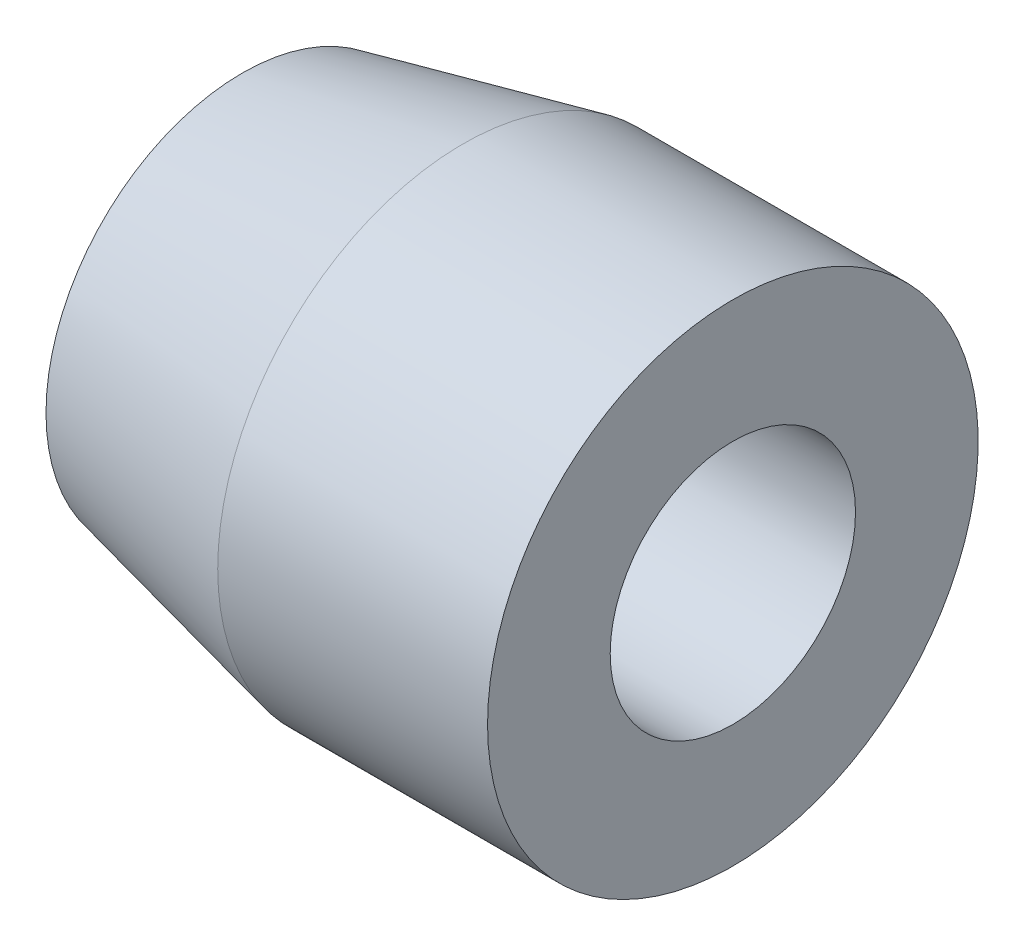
ISO-10303-21;
HEADER;
FILE_DESCRIPTION(('STEP AP214'),'2;1');
FILE_NAME('part.step','',(''),(''),'','','');
FILE_SCHEMA(('AUTOMOTIVE_DESIGN { 1 0 10303 214 1 1 1 1 }'));
ENDSEC;
DATA;
#1=APPLICATION_CONTEXT('core data for automotive mechanical design processes');
#2=APPLICATION_PROTOCOL_DEFINITION('international standard','automotive_design',2000,#1);
#3=PRODUCT_CONTEXT('',#1,'mechanical');
#4=PRODUCT('Part','Part','',(#3));
#5=PRODUCT_RELATED_PRODUCT_CATEGORY('part','',(#4));
#6=PRODUCT_DEFINITION_FORMATION('','',#4);
#7=PRODUCT_DEFINITION_CONTEXT('part definition',#1,'design');
#8=PRODUCT_DEFINITION('design','',#6,#7);
#9=PRODUCT_DEFINITION_SHAPE('','',#8);
#10=(LENGTH_UNIT() NAMED_UNIT(*) SI_UNIT(.MILLI.,.METRE.));
#11=(NAMED_UNIT(*) PLANE_ANGLE_UNIT() SI_UNIT($,.RADIAN.));
#12=(NAMED_UNIT(*) SI_UNIT($,.STERADIAN.) SOLID_ANGLE_UNIT());
#13=UNCERTAINTY_MEASURE_WITH_UNIT(LENGTH_MEASURE(1.E-05),#10,'distance_accuracy_value','');
#14=(GEOMETRIC_REPRESENTATION_CONTEXT(3) GLOBAL_UNCERTAINTY_ASSIGNED_CONTEXT((#13)) GLOBAL_UNIT_ASSIGNED_CONTEXT((#10,
#11,#12)) REPRESENTATION_CONTEXT('',''));
#15=CARTESIAN_POINT('',(0.,0.,0.));
#16=DIRECTION('',(0.,0.,1.));
#17=DIRECTION('',(1.,0.,0.));
#18=AXIS2_PLACEMENT_3D('',#15,#16,#17);
#19=CARTESIAN_POINT('',(0.,0.,0.));
#20=DIRECTION('',(1.,0.,0.));
#21=DIRECTION('',(0.,0.,-1.));
#22=AXIS2_PLACEMENT_3D('',#19,#20,#21);
#23=PLANE('',#22);
#24=CARTESIAN_POINT('',(0.,5.,0.));
#25=DIRECTION('',(1.,0.,0.));
#26=DIRECTION('',(0.,0.,-1.));
#27=AXIS2_PLACEMENT_3D('',#24,#25,#26);
#28=CIRCLE('',#27,2.5);
#29=CARTESIAN_POINT('',(0.,5.,-2.5));
#30=VERTEX_POINT('',#29);
#31=EDGE_CURVE('E143',#30,#30,#28,.T.);
#32=ORIENTED_EDGE('',*,*,#31,.F.);
#33=EDGE_LOOP('',(#32));
#34=FACE_BOUND('',#33,.T.);
#35=CARTESIAN_POINT('',(0.,5.,0.));
#36=DIRECTION('',(-1.,0.,0.));
#37=DIRECTION('',(0.,0.,1.));
#38=AXIS2_PLACEMENT_3D('',#35,#36,#37);
#39=CIRCLE('',#38,5.);
#40=CARTESIAN_POINT('',(0.,5.,5.));
#41=VERTEX_POINT('',#40);
#42=EDGE_CURVE('E11',#41,#41,#39,.T.);
#43=ORIENTED_EDGE('',*,*,#42,.F.);
#44=EDGE_LOOP('',(#43));
#45=FACE_BOUND('',#44,.T.);
#46=ADVANCED_FACE('F32',(#34,#45),#23,.T.);
#47=CARTESIAN_POINT('',(-40.,5.,0.));
#48=DIRECTION('',(-1.,0.,0.));
#49=DIRECTION('',(0.,0.,1.));
#50=AXIS2_PLACEMENT_3D('',#47,#48,#49);
#51=CYLINDRICAL_SURFACE('',#50,5.);
#52=ORIENTED_EDGE('',*,*,#42,.T.);
#53=EDGE_LOOP('',(#52));
#54=FACE_BOUND('',#53,.T.);
#55=CARTESIAN_POINT('',(-5.5,5.,0.));
#56=DIRECTION('',(-1.,0.,0.));
#57=DIRECTION('',(0.,0.,1.));
#58=AXIS2_PLACEMENT_3D('',#55,#56,#57);
#59=CIRCLE('',#58,5.);
#60=CARTESIAN_POINT('',(-5.5,5.,5.));
#61=VERTEX_POINT('',#60);
#62=EDGE_CURVE('E39',#61,#61,#59,.T.);
#63=ORIENTED_EDGE('',*,*,#62,.F.);
#64=EDGE_LOOP('',(#63));
#65=FACE_BOUND('',#64,.T.);
#66=ADVANCED_FACE('F154',(#54,#65),#51,.T.);
#67=CARTESIAN_POINT('',(-9.99999999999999,5.,0.));
#68=DIRECTION('',(1.,0.,0.));
#69=DIRECTION('',(0.,0.,-1.));
#70=AXIS2_PLACEMENT_3D('',#67,#68,#69);
#71=CONICAL_SURFACE('',#70,4.,0.218668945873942);
#72=ORIENTED_EDGE('',*,*,#62,.T.);
#73=EDGE_LOOP('',(#72));
#74=FACE_BOUND('',#73,.T.);
#75=CARTESIAN_POINT('',(-9.99999999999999,5.,0.));
#76=DIRECTION('',(-1.,0.,0.));
#77=DIRECTION('',(0.,0.,1.));
#78=AXIS2_PLACEMENT_3D('',#75,#76,#77);
#79=CIRCLE('',#78,4.);
#80=CARTESIAN_POINT('',(-9.99999999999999,5.,4.));
#81=VERTEX_POINT('',#80);
#82=EDGE_CURVE('E146',#81,#81,#79,.T.);
#83=ORIENTED_EDGE('',*,*,#82,.F.);
#84=EDGE_LOOP('',(#83));
#85=FACE_BOUND('',#84,.T.);
#86=ADVANCED_FACE('F151',(#74,#85),#71,.T.);
#87=CARTESIAN_POINT('',(-9.99999999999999,1.,0.));
#88=DIRECTION('',(-1.,0.,0.));
#89=DIRECTION('',(0.,0.,1.));
#90=AXIS2_PLACEMENT_3D('',#87,#88,#89);
#91=PLANE('',#90);
#92=DIRECTION('',(0.,0.866025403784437,-0.500000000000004));
#93=VECTOR('',#92,1.);
#94=CARTESIAN_POINT('',(-9.99999999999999,7.9419078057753,1.71247773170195));
#95=LINE('',#94,#93);
#96=CARTESIAN_POINT('',(-9.99999999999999,4.91081889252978,3.46247773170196));
#97=VERTEX_POINT('',#96);
#98=CARTESIAN_POINT('',(-9.99999999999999,7.9419078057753,1.71247773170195));
#99=VERTEX_POINT('',#98);
#100=EDGE_CURVE('E46',#97,#99,#95,.T.);
#101=ORIENTED_EDGE('',*,*,#100,.F.);
#102=DIRECTION('',(0.,0.866025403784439,0.5));
#103=VECTOR('',#102,1.);
#104=CARTESIAN_POINT('',(-9.99999999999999,4.91081889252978,3.46247773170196));
#105=LINE('',#104,#103);
#106=CARTESIAN_POINT('',(-9.99999999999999,1.87972997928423,1.71247773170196));
#107=VERTEX_POINT('',#106);
#108=EDGE_CURVE('E116',#107,#97,#105,.T.);
#109=ORIENTED_EDGE('',*,*,#108,.F.);
#110=DIRECTION('',(0.,0.,1.));
#111=VECTOR('',#110,1.);
#112=CARTESIAN_POINT('',(-9.99999999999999,1.87972997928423,1.71247773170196));
#113=LINE('',#112,#111);
#114=CARTESIAN_POINT('',(-9.99999999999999,1.87972997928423,-1.78752226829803));
#115=VERTEX_POINT('',#114);
#116=EDGE_CURVE('E110',#115,#107,#113,.T.);
#117=ORIENTED_EDGE('',*,*,#116,.F.);
#118=DIRECTION('',(0.,-0.866025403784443,0.499999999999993));
#119=VECTOR('',#118,1.);
#120=CARTESIAN_POINT('',(-9.99999999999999,1.87972997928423,-1.78752226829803));
#121=LINE('',#120,#119);
#122=CARTESIAN_POINT('',(-9.99999999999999,4.91081889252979,-3.53752226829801));
#123=VERTEX_POINT('',#122);
#124=EDGE_CURVE('E108',#123,#115,#121,.T.);
#125=ORIENTED_EDGE('',*,*,#124,.F.);
#126=DIRECTION('',(0.,-0.866025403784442,-0.499999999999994));
#127=VECTOR('',#126,1.);
#128=CARTESIAN_POINT('',(-9.99999999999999,4.91081889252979,-3.53752226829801));
#129=LINE('',#128,#127);
#130=CARTESIAN_POINT('',(-9.99999999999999,7.9419078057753,-1.78752226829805));
#131=VERTEX_POINT('',#130);
#132=EDGE_CURVE('E89',#131,#123,#129,.T.);
#133=ORIENTED_EDGE('',*,*,#132,.F.);
#134=DIRECTION('',(0.,0.,-1.));
#135=VECTOR('',#134,1.);
#136=CARTESIAN_POINT('',(-9.99999999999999,7.9419078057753,-1.78752226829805));
#137=LINE('',#136,#135);
#138=EDGE_CURVE('E100',#99,#131,#137,.T.);
#139=ORIENTED_EDGE('',*,*,#138,.F.);
#140=EDGE_LOOP('',(#101,#109,#117,#125,#133,#139));
#141=FACE_BOUND('',#140,.T.);
#142=ORIENTED_EDGE('',*,*,#82,.T.);
#143=EDGE_LOOP('',(#142));
#144=FACE_BOUND('',#143,.T.);
#145=ADVANCED_FACE('F104',(#141,#144),#91,.T.);
#146=CARTESIAN_POINT('',(-7.,5.,0.));
#147=DIRECTION('',(1.,0.,0.));
#148=DIRECTION('',(0.,0.,-1.));
#149=AXIS2_PLACEMENT_3D('',#146,#147,#148);
#150=CYLINDRICAL_SURFACE('',#149,2.5);
#151=CARTESIAN_POINT('',(-6.99999999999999,5.,0.));
#152=DIRECTION('',(1.,0.,0.));
#153=DIRECTION('',(0.,0.,-1.));
#154=AXIS2_PLACEMENT_3D('',#151,#152,#153);
#155=CIRCLE('',#154,2.5);
#156=CARTESIAN_POINT('',(-6.99999999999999,5.,-2.5));
#157=VERTEX_POINT('',#156);
#158=EDGE_CURVE('E134',#157,#157,#155,.F.);
#159=ORIENTED_EDGE('',*,*,#158,.T.);
#160=EDGE_LOOP('',(#159));
#161=FACE_BOUND('',#160,.T.);
#162=ORIENTED_EDGE('',*,*,#31,.T.);
#163=EDGE_LOOP('',(#162));
#164=FACE_BOUND('',#163,.T.);
#165=ADVANCED_FACE('F166',(#161,#164),#150,.F.);
#166=CARTESIAN_POINT('',(-6.99999999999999,4.91081889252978,3.46247773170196));
#167=DIRECTION('',(1.,0.,0.));
#168=DIRECTION('',(0.,0.,-1.));
#169=AXIS2_PLACEMENT_3D('',#166,#167,#168);
#170=PLANE('',#169);
#171=DIRECTION('',(0.,0.866025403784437,-0.500000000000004));
#172=VECTOR('',#171,1.);
#173=CARTESIAN_POINT('',(-6.99999999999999,7.9419078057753,1.71247773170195));
#174=LINE('',#173,#172);
#175=CARTESIAN_POINT('',(-6.99999999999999,4.91081889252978,3.46247773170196));
#176=VERTEX_POINT('',#175);
#177=CARTESIAN_POINT('',(-6.99999999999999,7.9419078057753,1.71247773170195));
#178=VERTEX_POINT('',#177);
#179=EDGE_CURVE('E118',#176,#178,#174,.T.);
#180=ORIENTED_EDGE('',*,*,#179,.T.);
#181=DIRECTION('',(0.,0.,-1.));
#182=VECTOR('',#181,1.);
#183=CARTESIAN_POINT('',(-6.99999999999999,7.9419078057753,-1.78752226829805));
#184=LINE('',#183,#182);
#185=CARTESIAN_POINT('',(-6.99999999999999,7.9419078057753,-1.78752226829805));
#186=VERTEX_POINT('',#185);
#187=EDGE_CURVE('E121',#178,#186,#184,.T.);
#188=ORIENTED_EDGE('',*,*,#187,.T.);
#189=DIRECTION('',(0.,-0.866025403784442,-0.499999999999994));
#190=VECTOR('',#189,1.);
#191=CARTESIAN_POINT('',(-6.99999999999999,4.91081889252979,-3.53752226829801));
#192=LINE('',#191,#190);
#193=CARTESIAN_POINT('',(-6.99999999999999,4.91081889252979,-3.53752226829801));
#194=VERTEX_POINT('',#193);
#195=EDGE_CURVE('E92',#186,#194,#192,.T.);
#196=ORIENTED_EDGE('',*,*,#195,.T.);
#197=DIRECTION('',(0.,-0.866025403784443,0.499999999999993));
#198=VECTOR('',#197,1.);
#199=CARTESIAN_POINT('',(-6.99999999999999,1.87972997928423,-1.78752226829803));
#200=LINE('',#199,#198);
#201=CARTESIAN_POINT('',(-6.99999999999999,1.87972997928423,-1.78752226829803));
#202=VERTEX_POINT('',#201);
#203=EDGE_CURVE('E124',#194,#202,#200,.T.);
#204=ORIENTED_EDGE('',*,*,#203,.T.);
#205=DIRECTION('',(0.,0.,1.));
#206=VECTOR('',#205,1.);
#207=CARTESIAN_POINT('',(-6.99999999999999,1.87972997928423,1.71247773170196));
#208=LINE('',#207,#206);
#209=CARTESIAN_POINT('',(-6.99999999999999,1.87972997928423,1.71247773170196));
#210=VERTEX_POINT('',#209);
#211=EDGE_CURVE('E127',#202,#210,#208,.T.);
#212=ORIENTED_EDGE('',*,*,#211,.T.);
#213=DIRECTION('',(0.,0.866025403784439,0.5));
#214=VECTOR('',#213,1.);
#215=CARTESIAN_POINT('',(-6.99999999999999,4.91081889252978,3.46247773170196));
#216=LINE('',#215,#214);
#217=EDGE_CURVE('E130',#210,#176,#216,.T.);
#218=ORIENTED_EDGE('',*,*,#217,.T.);
#219=EDGE_LOOP('',(#180,#188,#196,#204,#212,#218));
#220=FACE_BOUND('',#219,.T.);
#221=ORIENTED_EDGE('',*,*,#158,.F.);
#222=EDGE_LOOP('',(#221));
#223=FACE_BOUND('',#222,.T.);
#224=ADVANCED_FACE('F169',(#220,#223),#170,.F.);
#225=CARTESIAN_POINT('',(-6.99999999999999,7.9419078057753,1.71247773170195));
#226=DIRECTION('',(0.,0.500000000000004,0.866025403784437));
#227=DIRECTION('',(0.,-0.866025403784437,0.500000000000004));
#228=AXIS2_PLACEMENT_3D('',#225,#226,#227);
#229=PLANE('',#228);
#230=ORIENTED_EDGE('',*,*,#100,.T.);
#231=DIRECTION('',(-1.,0.,0.));
#232=VECTOR('',#231,1.);
#233=CARTESIAN_POINT('',(-6.99999999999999,7.9419078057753,1.71247773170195));
#234=LINE('',#233,#232);
#235=EDGE_CURVE('E97',#178,#99,#234,.T.);
#236=ORIENTED_EDGE('',*,*,#235,.F.);
#237=ORIENTED_EDGE('',*,*,#179,.F.);
#238=DIRECTION('',(-1.,0.,0.));
#239=VECTOR('',#238,1.);
#240=CARTESIAN_POINT('',(-6.99999999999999,4.91081889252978,3.46247773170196));
#241=LINE('',#240,#239);
#242=EDGE_CURVE('E53',#176,#97,#241,.T.);
#243=ORIENTED_EDGE('',*,*,#242,.T.);
#244=EDGE_LOOP('',(#230,#236,#237,#243));
#245=FACE_BOUND('',#244,.T.);
#246=ADVANCED_FACE('F171',(#245),#229,.F.);
#247=CARTESIAN_POINT('',(-6.99999999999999,4.91081889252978,3.46247773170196));
#248=DIRECTION('',(0.,-0.5,0.866025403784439));
#249=DIRECTION('',(0.,-0.866025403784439,-0.5));
#250=AXIS2_PLACEMENT_3D('',#247,#248,#249);
#251=PLANE('',#250);
#252=ORIENTED_EDGE('',*,*,#108,.T.);
#253=ORIENTED_EDGE('',*,*,#242,.F.);
#254=ORIENTED_EDGE('',*,*,#217,.F.);
#255=DIRECTION('',(-1.,0.,0.));
#256=VECTOR('',#255,1.);
#257=CARTESIAN_POINT('',(-6.99999999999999,1.87972997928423,1.71247773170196));
#258=LINE('',#257,#256);
#259=EDGE_CURVE('E135',#210,#107,#258,.T.);
#260=ORIENTED_EDGE('',*,*,#259,.T.);
#261=EDGE_LOOP('',(#252,#253,#254,#260));
#262=FACE_BOUND('',#261,.T.);
#263=ADVANCED_FACE('F174',(#262),#251,.F.);
#264=CARTESIAN_POINT('',(-6.99999999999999,1.87972997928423,1.71247773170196));
#265=DIRECTION('',(0.,-1.,0.));
#266=DIRECTION('',(0.,0.,-1.));
#267=AXIS2_PLACEMENT_3D('',#264,#265,#266);
#268=PLANE('',#267);
#269=ORIENTED_EDGE('',*,*,#116,.T.);
#270=ORIENTED_EDGE('',*,*,#259,.F.);
#271=ORIENTED_EDGE('',*,*,#211,.F.);
#272=DIRECTION('',(-1.,0.,0.));
#273=VECTOR('',#272,1.);
#274=CARTESIAN_POINT('',(-6.99999999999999,1.87972997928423,-1.78752226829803));
#275=LINE('',#274,#273);
#276=EDGE_CURVE('E137',#202,#115,#275,.T.);
#277=ORIENTED_EDGE('',*,*,#276,.T.);
#278=EDGE_LOOP('',(#269,#270,#271,#277));
#279=FACE_BOUND('',#278,.T.);
#280=ADVANCED_FACE('F182',(#279),#268,.F.);
#281=CARTESIAN_POINT('',(-6.99999999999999,1.87972997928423,-1.78752226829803));
#282=DIRECTION('',(0.,-0.499999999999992,-0.866025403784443));
#283=DIRECTION('',(0.,0.866025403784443,-0.499999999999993));
#284=AXIS2_PLACEMENT_3D('',#281,#282,#283);
#285=PLANE('',#284);
#286=ORIENTED_EDGE('',*,*,#124,.T.);
#287=ORIENTED_EDGE('',*,*,#276,.F.);
#288=ORIENTED_EDGE('',*,*,#203,.F.);
#289=DIRECTION('',(-1.,0.,0.));
#290=VECTOR('',#289,1.);
#291=CARTESIAN_POINT('',(-6.99999999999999,4.91081889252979,-3.53752226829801));
#292=LINE('',#291,#290);
#293=EDGE_CURVE('E96',#194,#123,#292,.T.);
#294=ORIENTED_EDGE('',*,*,#293,.T.);
#295=EDGE_LOOP('',(#286,#287,#288,#294));
#296=FACE_BOUND('',#295,.T.);
#297=ADVANCED_FACE('F179',(#296),#285,.F.);
#298=CARTESIAN_POINT('',(-6.99999999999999,4.91081889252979,-3.53752226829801));
#299=DIRECTION('',(0.,0.499999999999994,-0.866025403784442));
#300=DIRECTION('',(0.,0.866025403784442,0.499999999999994));
#301=AXIS2_PLACEMENT_3D('',#298,#299,#300);
#302=PLANE('',#301);
#303=ORIENTED_EDGE('',*,*,#132,.T.);
#304=ORIENTED_EDGE('',*,*,#293,.F.);
#305=ORIENTED_EDGE('',*,*,#195,.F.);
#306=DIRECTION('',(-1.,0.,0.));
#307=VECTOR('',#306,1.);
#308=CARTESIAN_POINT('',(-6.99999999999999,7.9419078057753,-1.78752226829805));
#309=LINE('',#308,#307);
#310=EDGE_CURVE('E85',#186,#131,#309,.T.);
#311=ORIENTED_EDGE('',*,*,#310,.T.);
#312=EDGE_LOOP('',(#303,#304,#305,#311));
#313=FACE_BOUND('',#312,.T.);
#314=ADVANCED_FACE('F87',(#313),#302,.F.);
#315=CARTESIAN_POINT('',(-6.99999999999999,7.9419078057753,-1.78752226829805));
#316=DIRECTION('',(0.,1.,0.));
#317=DIRECTION('',(0.,0.,1.));
#318=AXIS2_PLACEMENT_3D('',#315,#316,#317);
#319=PLANE('',#318);
#320=ORIENTED_EDGE('',*,*,#138,.T.);
#321=ORIENTED_EDGE('',*,*,#310,.F.);
#322=ORIENTED_EDGE('',*,*,#187,.F.);
#323=ORIENTED_EDGE('',*,*,#235,.T.);
#324=EDGE_LOOP('',(#320,#321,#322,#323));
#325=FACE_BOUND('',#324,.T.);
#326=ADVANCED_FACE('F101',(#325),#319,.F.);
#327=CLOSED_SHELL('',(#46,#66,#86,#145,#165,#224,#246,#263,#280,#297,#314,#326));
#328=MANIFOLD_SOLID_BREP('B2',#327);
#329=ADVANCED_BREP_SHAPE_REPRESENTATION('',(#18,#328),#14);
#330=SHAPE_DEFINITION_REPRESENTATION(#9,#329);
ENDSEC;
END-ISO-10303-21;
